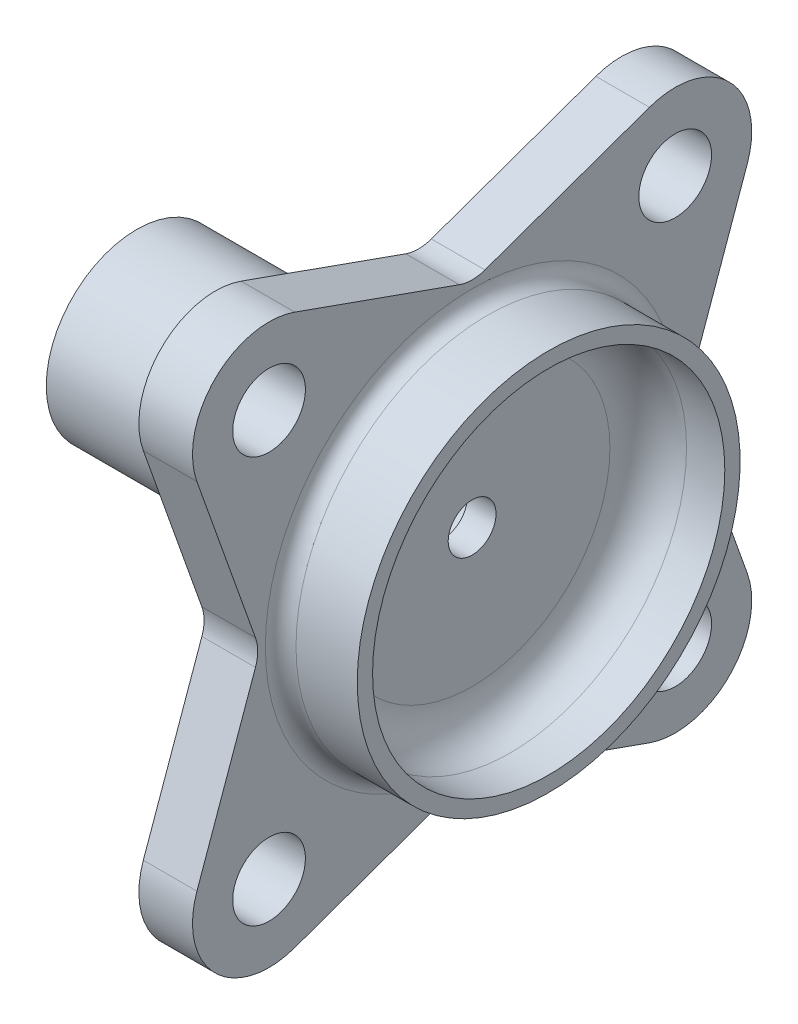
from build123d import *

# Parameters (mm, degrees)
SKETCH2_W                        = 76.2
SKETCH2_H                        = 63.5
F_15_32_0_46875_DIAMETER_HOLE1_D = 12.065
SKETCH13_OUTSIDE_W               = 168.02
SKETCH13_OUTSIDE_H               = 168.02
CUT_EXTRUDE1_DEPTH               = 118.774954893
SKETCH26_R                       = 15
SKETCH26_R_2                     = 7.9375
CUT_EXTRUDE2_DEPTH               = 7.874


with BuildPart() as part:
    # Sketch2 → Revolve2 (revolve)
    with BuildSketch(Plane.XY, mode=Mode.PRIVATE) as revolve2_sk:
        with Locations((38.1, 31.75)):
            Rectangle(SKETCH2_W, SKETCH2_H)
    revolve(revolve2_sk.sketch.rotate(Axis((-91.958947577, 0, 0), (1, 0, 0)), 90), axis=Axis((-91.958947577, 0, 0), (1, 0, 0)))

    # Sketch4 → Cut-Revolve1 (revolve, cut)
    with BuildSketch(Plane.XY, mode=Mode.PRIVATE) as cut_revolve1_sk:
        with BuildLine():
            Line((63.5, 63.5), (76.2, 63.5))
            Line((76.2, 63.5), (76.2, 31.75))
            Line((76.2, 31.75), (66.04, 31.75))
            ThreePointArc((66.04, 31.75), (64.243948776, 32.493948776), (63.5, 34.29))
            Line((63.5, 34.29), (63.5, 63.5))
        make_face()
    revolve(cut_revolve1_sk.sketch.rotate(Axis((-46.516862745, 0, 0), (1, 0, 0)), 90), axis=Axis((-46.516862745, 0, 0), (1, 0, 0)), mode=Mode.SUBTRACT)

    # Sketch5 → Cut-Revolve2 (revolve, cut)
    with BuildSketch(Plane.XY, mode=Mode.PRIVATE) as cut_revolve2_sk:
        with BuildLine():
            Line((69.85, 29.21), (76.2, 29.21))
            Line((76.2, 29.21), (76.2, 0))
            Line((76.2, 0), (63.5, 0))
            Line((63.5, 0), (63.5, 22.86))
            ThreePointArc((63.5, 22.86), (65.359871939, 27.350128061), (69.85, 29.21))
        make_face()
    revolve(cut_revolve2_sk.sketch.rotate(Axis((216.384356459, 0, 0), (-1, 0, 0)), 90), axis=Axis((216.384356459, 0, 0), (-1, 0, 0)), mode=Mode.SUBTRACT)

    # Sketch6 → Cut-Revolve3 (revolve, cut)
    with BuildSketch(Plane.XY, mode=Mode.PRIVATE) as cut_revolve3_sk:
        with BuildLine():
            Line((0, 63.5), (54.61, 63.5))
            Line((54.61, 63.5), (54.61, 23.382))
            ThreePointArc((54.61, 23.382), (52.15496904, 17.45503096), (46.228, 15))
            Line((46.228, 15), (0, 15))
            Line((0, 15), (0, 63.5))
        make_face()
    revolve(cut_revolve3_sk.sketch.rotate(Axis((209.598646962, 0, 0), (-1, 0, 0)), 90), axis=Axis((209.598646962, 0, 0), (-1, 0, 0)), mode=Mode.SUBTRACT)

    # Sketch24 → Cut-Revolve5 (revolve, cut)
    with BuildSketch(Plane.XY, mode=Mode.PRIVATE) as cut_revolve5_sk:
        with BuildLine():
            Line((0, 0), (0, 7.9375))
            Line((0, 7.9375), (56.1975, 7.9375))
            ThreePointArc((56.1975, 7.9375), (57.993551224, 7.193551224), (58.7375, 5.3975))
            Line((58.7375, 5.3975), (58.7375, 3.96875))
            Line((58.7375, 3.96875), (63.5, 3.96875))
            Line((63.5, 3.96875), (63.5, 0))
            Line((63.5, 0), (0, 0))
        make_face()
    revolve(cut_revolve5_sk.sketch.rotate(Axis((-5.741035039, 0, 0), (1, 0, 0)), 90), axis=Axis((-5.741035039, 0, 0), (1, 0, 0)), mode=Mode.SUBTRACT)

    # 15_32 _0.46875_ Diameter Hole1 (through all)
    with Locations(Plane(origin=(63.5, 0, 0), x_dir=(0, 0, -1), z_dir=(1, 0, 0))):
        with Locations((33.675960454, 33.675960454), (33.675960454, -33.675960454), (-33.675960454, -33.675960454), (-33.675960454, 33.675960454)):
            Hole(F_15_32_0_46875_DIAMETER_HOLE1_D / 2)

    # Sketch13 outside → Cut-Extrude1 (cut, through all)
    with BuildSketch(Plane(origin=(76.2, 0, 0), x_dir=(0, 0, -1), z_dir=(1, 0, 0))):
        Rectangle(SKETCH13_OUTSIDE_W, SKETCH13_OUTSIDE_H)
        with BuildLine():
            Line((45.640618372, 29.417209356), (35.927671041, 2.129375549))
            ThreePointArc((35.927671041, 2.129375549), (35.56, 0), (35.927671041, -2.129375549))
            Line((35.927671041, -2.129375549), (45.640618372, -29.417209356))
            ThreePointArc((45.640618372, -29.417209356), (42.656216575, -42.656216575), (29.417209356, -45.640618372))
            Line((29.417209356, -45.640618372), (2.129375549, -35.927671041))
            ThreePointArc((2.129375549, -35.927671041), (0, -35.56), (-2.129375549, -35.927671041))
            Line((-2.129375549, -35.927671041), (-29.417209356, -45.640618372))
            ThreePointArc((-29.417209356, -45.640618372), (-42.656216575, -42.656216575), (-45.640618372, -29.417209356))
            Line((-45.640618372, -29.417209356), (-35.927671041, -2.129375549))
            ThreePointArc((-35.927671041, -2.129375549), (-35.56, 0), (-35.927671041, 2.129375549))
            Line((-35.927671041, 2.129375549), (-45.640618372, 29.417209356))
            ThreePointArc((-45.640618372, 29.417209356), (-42.656216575, 42.656216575), (-29.417209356, 45.640618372))
            Line((-29.417209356, 45.640618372), (-2.129375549, 35.927671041))
            ThreePointArc((-2.129375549, 35.927671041), (0, 35.56), (2.129375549, 35.927671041))
            Line((2.129375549, 35.927671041), (29.417209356, 45.640618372))
            ThreePointArc((29.417209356, 45.640618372), (42.656216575, 42.656216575), (45.640618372, 29.417209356))
        make_face(mode=Mode.SUBTRACT)
    extrude(amount=-CUT_EXTRUDE1_DEPTH, mode=Mode.SUBTRACT)

    # Sketch26 → Cut-Extrude2 (cut)
    with BuildSketch(Plane.ZY):
        with Locations(Location((0, 0, 0), (0, 0, 90))):
            Circle(SKETCH26_R)
        Circle(SKETCH26_R_2, mode=Mode.SUBTRACT)
    extrude(amount=-CUT_EXTRUDE2_DEPTH, mode=Mode.SUBTRACT)


solid = part.part
